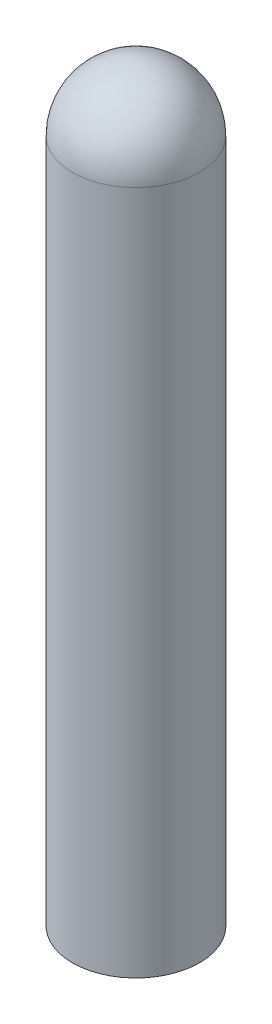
ISO-10303-21;
HEADER;
FILE_DESCRIPTION(('STEP AP214'),'2;1');
FILE_NAME('part.step','',(''),(''),'','','');
FILE_SCHEMA(('AUTOMOTIVE_DESIGN { 1 0 10303 214 1 1 1 1 }'));
ENDSEC;
DATA;
#1=APPLICATION_CONTEXT('core data for automotive mechanical design processes');
#2=APPLICATION_PROTOCOL_DEFINITION('international standard','automotive_design',2000,#1);
#3=PRODUCT_CONTEXT('',#1,'mechanical');
#4=PRODUCT('Part','Part','',(#3));
#5=PRODUCT_RELATED_PRODUCT_CATEGORY('part','',(#4));
#6=PRODUCT_DEFINITION_FORMATION('','',#4);
#7=PRODUCT_DEFINITION_CONTEXT('part definition',#1,'design');
#8=PRODUCT_DEFINITION('design','',#6,#7);
#9=PRODUCT_DEFINITION_SHAPE('','',#8);
#10=(LENGTH_UNIT() NAMED_UNIT(*) SI_UNIT(.MILLI.,.METRE.));
#11=(NAMED_UNIT(*) PLANE_ANGLE_UNIT() SI_UNIT($,.RADIAN.));
#12=(NAMED_UNIT(*) SI_UNIT($,.STERADIAN.) SOLID_ANGLE_UNIT());
#13=UNCERTAINTY_MEASURE_WITH_UNIT(LENGTH_MEASURE(1.E-05),#10,'distance_accuracy_value','');
#14=(GEOMETRIC_REPRESENTATION_CONTEXT(3) GLOBAL_UNCERTAINTY_ASSIGNED_CONTEXT((#13)) GLOBAL_UNIT_ASSIGNED_CONTEXT((#10,
#11,#12)) REPRESENTATION_CONTEXT('',''));
#15=CARTESIAN_POINT('',(0.,0.,0.));
#16=DIRECTION('',(0.,0.,1.));
#17=DIRECTION('',(1.,0.,0.));
#18=AXIS2_PLACEMENT_3D('',#15,#16,#17);
#19=CARTESIAN_POINT('',(0.,35.0000000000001,0.));
#20=DIRECTION('',(0.,-1.,0.));
#21=DIRECTION('',(0.,0.,-1.));
#22=AXIS2_PLACEMENT_3D('',#19,#20,#21);
#23=CYLINDRICAL_SURFACE('',#22,3.25);
#24=CARTESIAN_POINT('',(0.,35.0000000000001,0.));
#25=DIRECTION('',(0.,1.,0.));
#26=DIRECTION('',(0.,0.,1.));
#27=AXIS2_PLACEMENT_3D('',#24,#25,#26);
#28=CIRCLE('',#27,3.25);
#29=CARTESIAN_POINT('',(0.,35.0000000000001,3.25));
#30=VERTEX_POINT('',#29);
#31=EDGE_CURVE('E10',#30,#30,#28,.T.);
#32=ORIENTED_EDGE('',*,*,#31,.F.);
#33=EDGE_LOOP('',(#32));
#34=FACE_BOUND('',#33,.T.);
#35=CARTESIAN_POINT('',(0.,0.,-1.11022302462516E-13));
#36=DIRECTION('',(0.,1.,0.));
#37=DIRECTION('',(0.,0.,1.));
#38=AXIS2_PLACEMENT_3D('',#35,#36,#37);
#39=CIRCLE('',#38,3.25);
#40=CARTESIAN_POINT('',(0.,0.,3.24999999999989));
#41=VERTEX_POINT('',#40);
#42=EDGE_CURVE('E37',#41,#41,#39,.T.);
#43=ORIENTED_EDGE('',*,*,#42,.T.);
#44=EDGE_LOOP('',(#43));
#45=FACE_BOUND('',#44,.T.);
#46=ADVANCED_FACE('F30',(#34,#45),#23,.T.);
#47=CARTESIAN_POINT('',(0.,35.0000000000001,0.));
#48=DIRECTION('',(0.,0.,1.));
#49=DIRECTION('',(1.,0.,0.));
#50=AXIS2_PLACEMENT_3D('',#47,#48,#49);
#51=SPHERICAL_SURFACE('',#50,3.25);
#52=CARTESIAN_POINT('',(0.,35.0000000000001,0.));
#53=DIRECTION('',(0.,1.,0.));
#54=DIRECTION('',(0.,0.,1.));
#55=AXIS2_PLACEMENT_3D('',#52,#53,#54);
#56=SPHERICAL_SURFACE('',#55,3.25);
#57=ORIENTED_EDGE('',*,*,#31,.T.);
#58=EDGE_LOOP('',(#57));
#59=FACE_BOUND('',#58,.T.);
#60=ADVANCED_FACE('F32',(#59),#56,.T.);
#61=CARTESIAN_POINT('',(0.,0.,-1.11022302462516E-13));
#62=DIRECTION('',(0.,1.,0.));
#63=DIRECTION('',(0.,0.,1.));
#64=AXIS2_PLACEMENT_3D('',#61,#62,#63);
#65=PLANE('',#64);
#66=ORIENTED_EDGE('',*,*,#42,.F.);
#67=EDGE_LOOP('',(#66));
#68=FACE_BOUND('',#67,.T.);
#69=ADVANCED_FACE('F44',(#68),#65,.F.);
#70=CLOSED_SHELL('',(#46,#60,#69));
#71=MANIFOLD_SOLID_BREP('B2',#70);
#72=ADVANCED_BREP_SHAPE_REPRESENTATION('',(#18,#71),#14);
#73=SHAPE_DEFINITION_REPRESENTATION(#9,#72);
ENDSEC;
END-ISO-10303-21;
